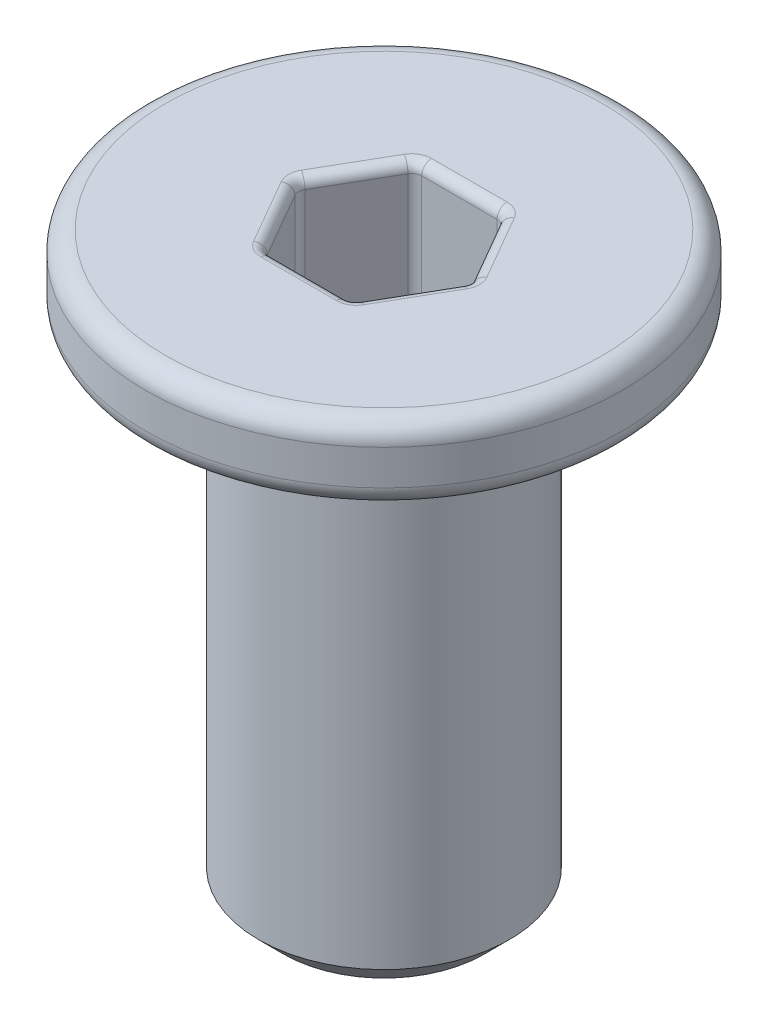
ISO-10303-21;
HEADER;
FILE_DESCRIPTION(('STEP AP214'),'2;1');
FILE_NAME('part.step','',(''),(''),'','','');
FILE_SCHEMA(('AUTOMOTIVE_DESIGN { 1 0 10303 214 1 1 1 1 }'));
ENDSEC;
DATA;
#1=APPLICATION_CONTEXT('core data for automotive mechanical design processes');
#2=APPLICATION_PROTOCOL_DEFINITION('international standard','automotive_design',2000,#1);
#3=PRODUCT_CONTEXT('',#1,'mechanical');
#4=PRODUCT('Part','Part','',(#3));
#5=PRODUCT_RELATED_PRODUCT_CATEGORY('part','',(#4));
#6=PRODUCT_DEFINITION_FORMATION('','',#4);
#7=PRODUCT_DEFINITION_CONTEXT('part definition',#1,'design');
#8=PRODUCT_DEFINITION('design','',#6,#7);
#9=PRODUCT_DEFINITION_SHAPE('','',#8);
#10=(LENGTH_UNIT() NAMED_UNIT(*) SI_UNIT(.MILLI.,.METRE.));
#11=(NAMED_UNIT(*) PLANE_ANGLE_UNIT() SI_UNIT($,.RADIAN.));
#12=(NAMED_UNIT(*) SI_UNIT($,.STERADIAN.) SOLID_ANGLE_UNIT());
#13=UNCERTAINTY_MEASURE_WITH_UNIT(LENGTH_MEASURE(1.E-05),#10,'distance_accuracy_value','');
#14=(GEOMETRIC_REPRESENTATION_CONTEXT(3) GLOBAL_UNCERTAINTY_ASSIGNED_CONTEXT((#13)) GLOBAL_UNIT_ASSIGNED_CONTEXT((#10,
#11,#12)) REPRESENTATION_CONTEXT('',''));
#15=CARTESIAN_POINT('',(0.,0.,0.));
#16=DIRECTION('',(0.,0.,1.));
#17=DIRECTION('',(1.,0.,0.));
#18=AXIS2_PLACEMENT_3D('',#15,#16,#17);
#19=CARTESIAN_POINT('',(0.,16.4999999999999,0.));
#20=DIRECTION('',(0.,1.,0.));
#21=DIRECTION('',(0.,0.,1.));
#22=AXIS2_PLACEMENT_3D('',#19,#20,#21);
#23=CYLINDRICAL_SURFACE('',#22,2.5);
#24=CARTESIAN_POINT('',(0.,-9.50000000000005,0.));
#25=DIRECTION('',(0.,1.,0.));
#26=DIRECTION('',(0.,0.,1.));
#27=AXIS2_PLACEMENT_3D('',#24,#25,#26);
#28=CIRCLE('',#27,2.5);
#29=CARTESIAN_POINT('',(0.,-9.50000000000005,2.5));
#30=VERTEX_POINT('',#29);
#31=EDGE_CURVE('E192',#30,#30,#28,.T.);
#32=ORIENTED_EDGE('',*,*,#31,.T.);
#33=EDGE_LOOP('',(#32));
#34=FACE_BOUND('',#33,.T.);
#35=CARTESIAN_POINT('',(0.,0.,0.));
#36=DIRECTION('',(0.,1.,0.));
#37=DIRECTION('',(0.,0.,1.));
#38=AXIS2_PLACEMENT_3D('',#35,#36,#37);
#39=CIRCLE('',#38,2.5);
#40=CARTESIAN_POINT('',(0.,0.,2.5));
#41=VERTEX_POINT('',#40);
#42=EDGE_CURVE('E285',#41,#41,#39,.T.);
#43=ORIENTED_EDGE('',*,*,#42,.F.);
#44=EDGE_LOOP('',(#43));
#45=FACE_BOUND('',#44,.T.);
#46=ADVANCED_FACE('F31',(#34,#45),#23,.T.);
#47=CARTESIAN_POINT('',(0.,-9.50000000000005,0.));
#48=DIRECTION('',(0.,1.,0.));
#49=DIRECTION('',(0.,0.,1.));
#50=AXIS2_PLACEMENT_3D('',#47,#48,#49);
#51=CONICAL_SURFACE('',#50,2.5,0.785398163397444);
#52=CARTESIAN_POINT('',(0.,-10.,0.));
#53=DIRECTION('',(0.,1.,0.));
#54=DIRECTION('',(0.,0.,1.));
#55=AXIS2_PLACEMENT_3D('',#52,#53,#54);
#56=CIRCLE('',#55,2.);
#57=CARTESIAN_POINT('',(0.,-10.,2.));
#58=VERTEX_POINT('',#57);
#59=EDGE_CURVE('E300',#58,#58,#56,.T.);
#60=ORIENTED_EDGE('',*,*,#59,.T.);
#61=EDGE_LOOP('',(#60));
#62=FACE_BOUND('',#61,.T.);
#63=ORIENTED_EDGE('',*,*,#31,.F.);
#64=EDGE_LOOP('',(#63));
#65=FACE_BOUND('',#64,.T.);
#66=ADVANCED_FACE('F524',(#62,#65),#51,.T.);
#67=CARTESIAN_POINT('',(-2.,-10.,0.));
#68=DIRECTION('',(0.,-1.,0.));
#69=DIRECTION('',(0.,0.,-1.));
#70=AXIS2_PLACEMENT_3D('',#67,#68,#69);
#71=PLANE('',#70);
#72=ORIENTED_EDGE('',*,*,#59,.F.);
#73=EDGE_LOOP('',(#72));
#74=FACE_BOUND('',#73,.T.);
#75=ADVANCED_FACE('F529',(#74),#71,.T.);
#76=CARTESIAN_POINT('',(-4.34999999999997,1.49999999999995,0.));
#77=DIRECTION('',(0.,1.,0.));
#78=DIRECTION('',(0.,0.,1.));
#79=AXIS2_PLACEMENT_3D('',#76,#77,#78);
#80=PLANE('',#79);
#81=CARTESIAN_POINT('',(0.750555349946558,1.49999999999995,1.30000000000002));
#82=DIRECTION('',(0.,1.,0.));
#83=DIRECTION('',(0.,0.,1.));
#84=AXIS2_PLACEMENT_3D('',#81,#82,#83);
#85=CIRCLE('',#84,0.4);
#86=CARTESIAN_POINT('',(0.750555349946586,1.49999999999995,1.70000000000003));
#87=VERTEX_POINT('',#86);
#88=CARTESIAN_POINT('',(1.09696551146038,1.49999999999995,1.50000000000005));
#89=VERTEX_POINT('',#88);
#90=EDGE_CURVE('E330',#87,#89,#85,.T.);
#91=ORIENTED_EDGE('',*,*,#90,.F.);
#92=DIRECTION('',(1.,0.,0.));
#93=VECTOR('',#92,1.);
#94=CARTESIAN_POINT('',(-0.866025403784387,1.49999999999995,1.70000000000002));
#95=LINE('',#94,#93);
#96=CARTESIAN_POINT('',(-0.750555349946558,1.49999999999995,1.70000000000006));
#97=VERTEX_POINT('',#96);
#98=EDGE_CURVE('E336',#87,#97,#95,.F.);
#99=ORIENTED_EDGE('',*,*,#98,.T.);
#100=CARTESIAN_POINT('',(-0.750555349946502,1.49999999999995,1.30000000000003));
#101=DIRECTION('',(0.,1.,0.));
#102=DIRECTION('',(0.,0.,1.));
#103=AXIS2_PLACEMENT_3D('',#100,#101,#102);
#104=CIRCLE('',#103,0.4);
#105=CARTESIAN_POINT('',(-1.0969655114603,1.49999999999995,1.50000000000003));
#106=VERTEX_POINT('',#105);
#107=EDGE_CURVE('E333',#106,#97,#104,.T.);
#108=ORIENTED_EDGE('',*,*,#107,.F.);
#109=DIRECTION('',(0.5,0.,0.866025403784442));
#110=VECTOR('',#109,1.);
#111=CARTESIAN_POINT('',(-1.03923048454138,1.49999999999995,1.60000000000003));
#112=LINE('',#111,#110);
#113=CARTESIAN_POINT('',(-1.8475208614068,1.49999999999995,0.199999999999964));
#114=VERTEX_POINT('',#113);
#115=EDGE_CURVE('E327',#106,#114,#112,.F.);
#116=ORIENTED_EDGE('',*,*,#115,.T.);
#117=CARTESIAN_POINT('',(-1.50111069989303,1.49999999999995,0.));
#118=DIRECTION('',(0.,1.,0.));
#119=DIRECTION('',(0.,0.,1.));
#120=AXIS2_PLACEMENT_3D('',#117,#118,#119);
#121=CIRCLE('',#120,0.4);
#122=CARTESIAN_POINT('',(-1.84752086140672,1.49999999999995,-0.199999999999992));
#123=VERTEX_POINT('',#122);
#124=EDGE_CURVE('E324',#123,#114,#121,.T.);
#125=ORIENTED_EDGE('',*,*,#124,.F.);
#126=DIRECTION('',(-0.499999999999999,0.,0.866025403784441));
#127=VECTOR('',#126,1.);
#128=CARTESIAN_POINT('',(-1.03923048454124,1.49999999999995,-1.59999999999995));
#129=LINE('',#128,#127);
#130=CARTESIAN_POINT('',(-1.09696551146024,1.49999999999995,-1.49999999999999));
#131=VERTEX_POINT('',#130);
#132=EDGE_CURVE('E322',#123,#131,#129,.F.);
#133=ORIENTED_EDGE('',*,*,#132,.T.);
#134=CARTESIAN_POINT('',(-0.750555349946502,1.49999999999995,-1.29999999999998));
#135=DIRECTION('',(0.,1.,0.));
#136=DIRECTION('',(0.,0.,1.));
#137=AXIS2_PLACEMENT_3D('',#134,#135,#136);
#138=CIRCLE('',#137,0.4);
#139=CARTESIAN_POINT('',(-0.750555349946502,1.49999999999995,-1.69999999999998));
#140=VERTEX_POINT('',#139);
#141=EDGE_CURVE('E319',#140,#131,#138,.T.);
#142=ORIENTED_EDGE('',*,*,#141,.F.);
#143=DIRECTION('',(-1.,0.,0.));
#144=VECTOR('',#143,1.);
#145=CARTESIAN_POINT('',(-0.866025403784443,1.49999999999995,-1.69999999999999));
#146=LINE('',#145,#144);
#147=CARTESIAN_POINT('',(0.750555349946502,1.49999999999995,-1.70000000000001));
#148=VERTEX_POINT('',#147);
#149=EDGE_CURVE('E317',#140,#148,#146,.F.);
#150=ORIENTED_EDGE('',*,*,#149,.T.);
#151=CARTESIAN_POINT('',(0.75055534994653,1.49999999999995,-1.29999999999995));
#152=DIRECTION('',(0.,1.,0.));
#153=DIRECTION('',(0.,0.,1.));
#154=AXIS2_PLACEMENT_3D('',#151,#152,#153);
#155=CIRCLE('',#154,0.4);
#156=CARTESIAN_POINT('',(1.0969655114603,1.49999999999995,-1.50000000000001));
#157=VERTEX_POINT('',#156);
#158=EDGE_CURVE('E314',#157,#148,#155,.T.);
#159=ORIENTED_EDGE('',*,*,#158,.F.);
#160=DIRECTION('',(-0.499999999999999,0.,-0.866025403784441));
#161=VECTOR('',#160,1.);
#162=CARTESIAN_POINT('',(1.03923048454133,1.49999999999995,-1.59999999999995));
#163=LINE('',#162,#161);
#164=CARTESIAN_POINT('',(1.84752086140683,1.49999999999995,-0.19999999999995));
#165=VERTEX_POINT('',#164);
#166=EDGE_CURVE('E310',#157,#165,#163,.F.);
#167=ORIENTED_EDGE('',*,*,#166,.T.);
#168=CARTESIAN_POINT('',(1.50111069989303,1.49999999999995,0.));
#169=DIRECTION('',(0.,1.,0.));
#170=DIRECTION('',(0.,0.,1.));
#171=AXIS2_PLACEMENT_3D('',#168,#169,#170);
#172=CIRCLE('',#171,0.4);
#173=CARTESIAN_POINT('',(1.84752086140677,1.49999999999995,0.20000000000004));
#174=VERTEX_POINT('',#173);
#175=EDGE_CURVE('E307',#174,#165,#172,.T.);
#176=ORIENTED_EDGE('',*,*,#175,.F.);
#177=DIRECTION('',(0.5,0.,-0.866025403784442));
#178=VECTOR('',#177,1.);
#179=CARTESIAN_POINT('',(1.03923048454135,1.49999999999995,1.60000000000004));
#180=LINE('',#179,#178);
#181=EDGE_CURVE('E312',#174,#89,#180,.F.);
#182=ORIENTED_EDGE('',*,*,#181,.T.);
#183=EDGE_LOOP('',(#91,#99,#108,#116,#125,#133,#142,#150,#159,#167,#176,#182));
#184=FACE_BOUND('',#183,.T.);
#185=CARTESIAN_POINT('',(0.,1.49999999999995,0.));
#186=DIRECTION('',(0.,1.,0.));
#187=DIRECTION('',(0.,0.,1.));
#188=AXIS2_PLACEMENT_3D('',#185,#186,#187);
#189=CIRCLE('',#188,4.35);
#190=CARTESIAN_POINT('',(0.,1.49999999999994,4.35000000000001));
#191=VERTEX_POINT('',#190);
#192=EDGE_CURVE('E297',#191,#191,#189,.T.);
#193=ORIENTED_EDGE('',*,*,#192,.T.);
#194=EDGE_LOOP('',(#193));
#195=FACE_BOUND('',#194,.T.);
#196=ADVANCED_FACE('F450',(#184,#195),#80,.T.);
#197=CARTESIAN_POINT('',(0.,1.09999999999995,0.));
#198=DIRECTION('',(0.,1.,0.));
#199=DIRECTION('',(0.,0.,1.));
#200=AXIS2_PLACEMENT_3D('',#197,#198,#199);
#201=TOROIDAL_SURFACE('',#200,4.35,0.4);
#202=CARTESIAN_POINT('',(0.,1.09999999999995,0.));
#203=DIRECTION('',(0.,1.,0.));
#204=DIRECTION('',(0.,0.,1.));
#205=AXIS2_PLACEMENT_3D('',#202,#203,#204);
#206=CIRCLE('',#205,4.75);
#207=CARTESIAN_POINT('',(0.,1.09999999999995,4.75000000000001));
#208=VERTEX_POINT('',#207);
#209=EDGE_CURVE('E294',#208,#208,#206,.T.);
#210=ORIENTED_EDGE('',*,*,#209,.T.);
#211=EDGE_LOOP('',(#210));
#212=FACE_BOUND('',#211,.T.);
#213=ORIENTED_EDGE('',*,*,#192,.F.);
#214=EDGE_LOOP('',(#213));
#215=FACE_BOUND('',#214,.T.);
#216=ADVANCED_FACE('F550',(#212,#215),#201,.T.);
#217=CARTESIAN_POINT('',(0.,16.4999999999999,0.));
#218=DIRECTION('',(0.,1.,0.));
#219=DIRECTION('',(0.,0.,1.));
#220=AXIS2_PLACEMENT_3D('',#217,#218,#219);
#221=CYLINDRICAL_SURFACE('',#220,4.75);
#222=CARTESIAN_POINT('',(0.,0.399999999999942,0.));
#223=DIRECTION('',(0.,1.,0.));
#224=DIRECTION('',(0.,0.,1.));
#225=AXIS2_PLACEMENT_3D('',#222,#223,#224);
#226=CIRCLE('',#225,4.75);
#227=CARTESIAN_POINT('',(0.,0.399999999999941,4.75000000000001));
#228=VERTEX_POINT('',#227);
#229=EDGE_CURVE('E291',#228,#228,#226,.T.);
#230=ORIENTED_EDGE('',*,*,#229,.T.);
#231=EDGE_LOOP('',(#230));
#232=FACE_BOUND('',#231,.T.);
#233=ORIENTED_EDGE('',*,*,#209,.F.);
#234=EDGE_LOOP('',(#233));
#235=FACE_BOUND('',#234,.T.);
#236=ADVANCED_FACE('F544',(#232,#235),#221,.T.);
#237=CARTESIAN_POINT('',(0.,0.399999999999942,0.));
#238=DIRECTION('',(0.,1.,0.));
#239=DIRECTION('',(0.,0.,1.));
#240=AXIS2_PLACEMENT_3D('',#237,#238,#239);
#241=TOROIDAL_SURFACE('',#240,4.35,0.4);
#242=CARTESIAN_POINT('',(0.,0.,0.));
#243=DIRECTION('',(0.,1.,0.));
#244=DIRECTION('',(0.,0.,1.));
#245=AXIS2_PLACEMENT_3D('',#242,#243,#244);
#246=CIRCLE('',#245,4.35);
#247=CARTESIAN_POINT('',(0.,0.,4.35000000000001));
#248=VERTEX_POINT('',#247);
#249=EDGE_CURVE('E288',#248,#248,#246,.T.);
#250=ORIENTED_EDGE('',*,*,#249,.T.);
#251=EDGE_LOOP('',(#250));
#252=FACE_BOUND('',#251,.T.);
#253=ORIENTED_EDGE('',*,*,#229,.F.);
#254=EDGE_LOOP('',(#253));
#255=FACE_BOUND('',#254,.T.);
#256=ADVANCED_FACE('F538',(#252,#255),#241,.T.);
#257=CARTESIAN_POINT('',(-2.49999999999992,0.,0.));
#258=DIRECTION('',(0.,-1.,0.));
#259=DIRECTION('',(0.,0.,-1.));
#260=AXIS2_PLACEMENT_3D('',#257,#258,#259);
#261=PLANE('',#260);
#262=ORIENTED_EDGE('',*,*,#42,.T.);
#263=EDGE_LOOP('',(#262));
#264=FACE_BOUND('',#263,.T.);
#265=ORIENTED_EDGE('',*,*,#249,.F.);
#266=EDGE_LOOP('',(#265));
#267=FACE_BOUND('',#266,.T.);
#268=ADVANCED_FACE('F535',(#264,#267),#261,.T.);
#269=CARTESIAN_POINT('',(-0.86602540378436,-3.50000000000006,1.50000000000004));
#270=DIRECTION('',(0.,0.,1.));
#271=DIRECTION('',(1.,0.,0.));
#272=AXIS2_PLACEMENT_3D('',#269,#270,#271);
#273=PLANE('',#272);
#274=DIRECTION('',(1.,0.,0.));
#275=VECTOR('',#274,1.);
#276=CARTESIAN_POINT('',(-0.86602540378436,-3.30000000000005,1.50000000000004));
#277=LINE('',#276,#275);
#278=CARTESIAN_POINT('',(0.750555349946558,-3.30000000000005,1.50000000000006));
#279=VERTEX_POINT('',#278);
#280=CARTESIAN_POINT('',(-0.750555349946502,-3.30000000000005,1.50000000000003));
#281=VERTEX_POINT('',#280);
#282=EDGE_CURVE('E356',#279,#281,#277,.F.);
#283=ORIENTED_EDGE('',*,*,#282,.T.);
#284=DIRECTION('',(0.,1.,0.));
#285=VECTOR('',#284,1.);
#286=CARTESIAN_POINT('',(-0.750555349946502,-3.50000000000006,1.50000000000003));
#287=LINE('',#286,#285);
#288=CARTESIAN_POINT('',(-0.750555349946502,1.29999999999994,1.50000000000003));
#289=VERTEX_POINT('',#288);
#290=EDGE_CURVE('E204',#281,#289,#287,.T.);
#291=ORIENTED_EDGE('',*,*,#290,.T.);
#292=DIRECTION('',(1.,0.,0.));
#293=VECTOR('',#292,1.);
#294=CARTESIAN_POINT('',(-0.86602540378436,1.29999999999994,1.50000000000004));
#295=LINE('',#294,#293);
#296=CARTESIAN_POINT('',(0.750555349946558,1.29999999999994,1.50000000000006));
#297=VERTEX_POINT('',#296);
#298=EDGE_CURVE('E360',#289,#297,#295,.T.);
#299=ORIENTED_EDGE('',*,*,#298,.T.);
#300=DIRECTION('',(0.,1.,0.));
#301=VECTOR('',#300,1.);
#302=CARTESIAN_POINT('',(0.750555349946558,-3.50000000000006,1.50000000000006));
#303=LINE('',#302,#301);
#304=EDGE_CURVE('E358',#297,#279,#303,.F.);
#305=ORIENTED_EDGE('',*,*,#304,.T.);
#306=EDGE_LOOP('',(#283,#291,#299,#305));
#307=FACE_BOUND('',#306,.T.);
#308=ADVANCED_FACE('F488',(#307),#273,.F.);
#309=CARTESIAN_POINT('',(-0.86602540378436,-3.50000000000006,1.50000000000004));
#310=DIRECTION('',(-0.866025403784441,0.,0.499999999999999));
#311=DIRECTION('',(0.5,0.,0.866025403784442));
#312=AXIS2_PLACEMENT_3D('',#309,#310,#311);
#313=PLANE('',#312);
#314=DIRECTION('',(0.,1.,0.));
#315=VECTOR('',#314,1.);
#316=CARTESIAN_POINT('',(-1.67431578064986,-3.50000000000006,0.100000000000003));
#317=LINE('',#316,#315);
#318=CARTESIAN_POINT('',(-1.67431578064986,-3.30000000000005,0.100000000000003));
#319=VERTEX_POINT('',#318);
#320=CARTESIAN_POINT('',(-1.67431578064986,1.29999999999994,0.100000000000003));
#321=VERTEX_POINT('',#320);
#322=EDGE_CURVE('E181',#319,#321,#317,.T.);
#323=ORIENTED_EDGE('',*,*,#322,.T.);
#324=DIRECTION('',(0.5,0.,0.866025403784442));
#325=VECTOR('',#324,1.);
#326=CARTESIAN_POINT('',(-0.86602540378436,1.29999999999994,1.50000000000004));
#327=LINE('',#326,#325);
#328=CARTESIAN_POINT('',(-0.923760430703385,1.29999999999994,1.4));
#329=VERTEX_POINT('',#328);
#330=EDGE_CURVE('E177',#321,#329,#327,.T.);
#331=ORIENTED_EDGE('',*,*,#330,.T.);
#332=DIRECTION('',(0.,1.,0.));
#333=VECTOR('',#332,1.);
#334=CARTESIAN_POINT('',(-0.923760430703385,-3.50000000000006,1.4));
#335=LINE('',#334,#333);
#336=CARTESIAN_POINT('',(-0.923760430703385,-3.30000000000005,1.4));
#337=VERTEX_POINT('',#336);
#338=EDGE_CURVE('E171',#329,#337,#335,.F.);
#339=ORIENTED_EDGE('',*,*,#338,.T.);
#340=DIRECTION('',(0.5,0.,0.866025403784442));
#341=VECTOR('',#340,1.);
#342=CARTESIAN_POINT('',(-0.86602540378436,-3.30000000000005,1.50000000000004));
#343=LINE('',#342,#341);
#344=EDGE_CURVE('E174',#337,#319,#343,.F.);
#345=ORIENTED_EDGE('',*,*,#344,.T.);
#346=EDGE_LOOP('',(#323,#331,#339,#345));
#347=FACE_BOUND('',#346,.T.);
#348=ADVANCED_FACE('F173',(#347),#313,.F.);
#349=CARTESIAN_POINT('',(-0.866025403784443,-3.50000000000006,-1.49999999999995));
#350=DIRECTION('',(-0.866025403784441,0.,-0.499999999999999));
#351=DIRECTION('',(-0.499999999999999,0.,0.866025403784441));
#352=AXIS2_PLACEMENT_3D('',#349,#350,#351);
#353=PLANE('',#352);
#354=DIRECTION('',(-0.499999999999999,0.,0.866025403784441));
#355=VECTOR('',#354,1.);
#356=CARTESIAN_POINT('',(-0.866025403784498,1.29999999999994,-1.49999999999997));
#357=LINE('',#356,#355);
#358=CARTESIAN_POINT('',(-0.923760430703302,1.29999999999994,-1.39999999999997));
#359=VERTEX_POINT('',#358);
#360=CARTESIAN_POINT('',(-1.67431578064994,1.29999999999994,-0.0999999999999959));
#361=VERTEX_POINT('',#360);
#362=EDGE_CURVE('E342',#359,#361,#357,.T.);
#363=ORIENTED_EDGE('',*,*,#362,.T.);
#364=DIRECTION('',(0.,1.,0.));
#365=VECTOR('',#364,1.);
#366=CARTESIAN_POINT('',(-1.67431578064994,-3.50000000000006,-0.0999999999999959));
#367=LINE('',#366,#365);
#368=CARTESIAN_POINT('',(-1.67431578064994,-3.30000000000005,-0.0999999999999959));
#369=VERTEX_POINT('',#368);
#370=EDGE_CURVE('E344',#361,#369,#367,.F.);
#371=ORIENTED_EDGE('',*,*,#370,.T.);
#372=DIRECTION('',(-0.499999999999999,0.,0.866025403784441));
#373=VECTOR('',#372,1.);
#374=CARTESIAN_POINT('',(-0.866025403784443,-3.30000000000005,-1.49999999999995));
#375=LINE('',#374,#373);
#376=CARTESIAN_POINT('',(-0.923760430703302,-3.30000000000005,-1.39999999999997));
#377=VERTEX_POINT('',#376);
#378=EDGE_CURVE('E338',#369,#377,#375,.F.);
#379=ORIENTED_EDGE('',*,*,#378,.T.);
#380=DIRECTION('',(0.,1.,0.));
#381=VECTOR('',#380,1.);
#382=CARTESIAN_POINT('',(-0.923760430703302,-3.50000000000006,-1.39999999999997));
#383=LINE('',#382,#381);
#384=EDGE_CURVE('E340',#377,#359,#383,.T.);
#385=ORIENTED_EDGE('',*,*,#384,.T.);
#386=EDGE_LOOP('',(#363,#371,#379,#385));
#387=FACE_BOUND('',#386,.T.);
#388=ADVANCED_FACE('F577',(#387),#353,.F.);
#389=CARTESIAN_POINT('',(-0.866025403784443,-3.50000000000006,-1.49999999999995));
#390=DIRECTION('',(0.,0.,-1.));
#391=DIRECTION('',(-1.,0.,0.));
#392=AXIS2_PLACEMENT_3D('',#389,#390,#391);
#393=PLANE('',#392);
#394=DIRECTION('',(-1.,0.,0.));
#395=VECTOR('',#394,1.);
#396=CARTESIAN_POINT('',(-0.866025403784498,1.29999999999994,-1.49999999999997));
#397=LINE('',#396,#395);
#398=CARTESIAN_POINT('',(0.750555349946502,1.29999999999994,-1.50000000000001));
#399=VERTEX_POINT('',#398);
#400=CARTESIAN_POINT('',(-0.750555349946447,1.29999999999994,-1.49999999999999));
#401=VERTEX_POINT('',#400);
#402=EDGE_CURVE('E351',#399,#401,#397,.T.);
#403=ORIENTED_EDGE('',*,*,#402,.T.);
#404=DIRECTION('',(0.,1.,0.));
#405=VECTOR('',#404,1.);
#406=CARTESIAN_POINT('',(-0.750555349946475,-3.50000000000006,-1.49999999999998));
#407=LINE('',#406,#405);
#408=CARTESIAN_POINT('',(-0.750555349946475,-3.30000000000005,-1.49999999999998));
#409=VERTEX_POINT('',#408);
#410=EDGE_CURVE('E353',#401,#409,#407,.F.);
#411=ORIENTED_EDGE('',*,*,#410,.T.);
#412=DIRECTION('',(-1.,0.,0.));
#413=VECTOR('',#412,1.);
#414=CARTESIAN_POINT('',(-0.866025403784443,-3.30000000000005,-1.49999999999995));
#415=LINE('',#414,#413);
#416=CARTESIAN_POINT('',(0.750555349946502,-3.30000000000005,-1.50000000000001));
#417=VERTEX_POINT('',#416);
#418=EDGE_CURVE('E347',#409,#417,#415,.F.);
#419=ORIENTED_EDGE('',*,*,#418,.T.);
#420=DIRECTION('',(0.,1.,0.));
#421=VECTOR('',#420,1.);
#422=CARTESIAN_POINT('',(0.750555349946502,-3.50000000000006,-1.50000000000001));
#423=LINE('',#422,#421);
#424=EDGE_CURVE('E349',#417,#399,#423,.T.);
#425=ORIENTED_EDGE('',*,*,#424,.T.);
#426=EDGE_LOOP('',(#403,#411,#419,#425));
#427=FACE_BOUND('',#426,.T.);
#428=ADVANCED_FACE('F573',(#427),#393,.F.);
#429=CARTESIAN_POINT('',(0.866025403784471,-3.50000000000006,-1.49999999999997));
#430=DIRECTION('',(0.866025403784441,0.,-0.499999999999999));
#431=DIRECTION('',(-0.499999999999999,0.,-0.866025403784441));
#432=AXIS2_PLACEMENT_3D('',#429,#430,#431);
#433=PLANE('',#432);
#434=DIRECTION('',(0.,1.,0.));
#435=VECTOR('',#434,1.);
#436=CARTESIAN_POINT('',(1.67431578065,-3.50000000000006,-0.0999999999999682));
#437=LINE('',#436,#435);
#438=CARTESIAN_POINT('',(1.67431578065,-3.30000000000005,-0.0999999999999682));
#439=VERTEX_POINT('',#438);
#440=CARTESIAN_POINT('',(1.67431578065,1.29999999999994,-0.0999999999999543));
#441=VERTEX_POINT('',#440);
#442=EDGE_CURVE('E376',#439,#441,#437,.T.);
#443=ORIENTED_EDGE('',*,*,#442,.T.);
#444=DIRECTION('',(-0.499999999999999,0.,-0.866025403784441));
#445=VECTOR('',#444,1.);
#446=CARTESIAN_POINT('',(0.866025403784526,1.29999999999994,-1.49999999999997));
#447=LINE('',#446,#445);
#448=CARTESIAN_POINT('',(0.923760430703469,1.29999999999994,-1.39999999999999));
#449=VERTEX_POINT('',#448);
#450=EDGE_CURVE('E379',#441,#449,#447,.T.);
#451=ORIENTED_EDGE('',*,*,#450,.T.);
#452=DIRECTION('',(0.,1.,0.));
#453=VECTOR('',#452,1.);
#454=CARTESIAN_POINT('',(0.923760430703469,-3.50000000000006,-1.39999999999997));
#455=LINE('',#454,#453);
#456=CARTESIAN_POINT('',(0.923760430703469,-3.30000000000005,-1.39999999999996));
#457=VERTEX_POINT('',#456);
#458=EDGE_CURVE('E374',#449,#457,#455,.F.);
#459=ORIENTED_EDGE('',*,*,#458,.T.);
#460=DIRECTION('',(-0.499999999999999,0.,-0.866025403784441));
#461=VECTOR('',#460,1.);
#462=CARTESIAN_POINT('',(0.866025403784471,-3.30000000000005,-1.49999999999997));
#463=LINE('',#462,#461);
#464=EDGE_CURVE('E372',#457,#439,#463,.F.);
#465=ORIENTED_EDGE('',*,*,#464,.T.);
#466=EDGE_LOOP('',(#443,#451,#459,#465));
#467=FACE_BOUND('',#466,.T.);
#468=ADVANCED_FACE('F570',(#467),#433,.F.);
#469=CARTESIAN_POINT('',(0.866025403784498,-3.50000000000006,1.50000000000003));
#470=DIRECTION('',(0.866025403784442,0.,0.499999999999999));
#471=DIRECTION('',(0.5,0.,-0.866025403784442));
#472=AXIS2_PLACEMENT_3D('',#469,#470,#471);
#473=PLANE('',#472);
#474=DIRECTION('',(0.5,0.,-0.866025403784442));
#475=VECTOR('',#474,1.);
#476=CARTESIAN_POINT('',(0.866025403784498,-3.30000000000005,1.50000000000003));
#477=LINE('',#476,#475);
#478=CARTESIAN_POINT('',(1.67431578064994,-3.30000000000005,0.100000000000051));
#479=VERTEX_POINT('',#478);
#480=CARTESIAN_POINT('',(0.923760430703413,-3.30000000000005,1.40000000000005));
#481=VERTEX_POINT('',#480);
#482=EDGE_CURVE('E363',#479,#481,#477,.F.);
#483=ORIENTED_EDGE('',*,*,#482,.T.);
#484=DIRECTION('',(0.,1.,0.));
#485=VECTOR('',#484,1.);
#486=CARTESIAN_POINT('',(0.923760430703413,-3.50000000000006,1.40000000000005));
#487=LINE('',#486,#485);
#488=CARTESIAN_POINT('',(0.923760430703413,1.29999999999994,1.40000000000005));
#489=VERTEX_POINT('',#488);
#490=EDGE_CURVE('E369',#481,#489,#487,.T.);
#491=ORIENTED_EDGE('',*,*,#490,.T.);
#492=DIRECTION('',(0.5,0.,-0.866025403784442));
#493=VECTOR('',#492,1.);
#494=CARTESIAN_POINT('',(0.866025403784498,1.29999999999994,1.50000000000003));
#495=LINE('',#494,#493);
#496=CARTESIAN_POINT('',(1.67431578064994,1.29999999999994,0.100000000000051));
#497=VERTEX_POINT('',#496);
#498=EDGE_CURVE('E367',#489,#497,#495,.T.);
#499=ORIENTED_EDGE('',*,*,#498,.T.);
#500=DIRECTION('',(0.,1.,0.));
#501=VECTOR('',#500,1.);
#502=CARTESIAN_POINT('',(1.67431578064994,-3.50000000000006,0.100000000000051));
#503=LINE('',#502,#501);
#504=EDGE_CURVE('E365',#497,#479,#503,.F.);
#505=ORIENTED_EDGE('',*,*,#504,.T.);
#506=EDGE_LOOP('',(#483,#491,#499,#505));
#507=FACE_BOUND('',#506,.T.);
#508=ADVANCED_FACE('F505',(#507),#473,.F.);
#509=CARTESIAN_POINT('',(0.866025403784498,-3.50000000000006,1.50000000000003));
#510=DIRECTION('',(0.,1.,0.));
#511=DIRECTION('',(0.,0.,1.));
#512=AXIS2_PLACEMENT_3D('',#509,#510,#511);
#513=PLANE('',#512);
#514=DIRECTION('',(-0.499999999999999,0.,0.866025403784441));
#515=VECTOR('',#514,1.);
#516=CARTESIAN_POINT('',(-1.55884572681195,-3.50000000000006,0.100000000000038));
#517=LINE('',#516,#515);
#518=CARTESIAN_POINT('',(-0.750555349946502,-3.50000000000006,-1.29999999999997));
#519=VERTEX_POINT('',#518);
#520=CARTESIAN_POINT('',(-1.50111069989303,-3.50000000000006,0.));
#521=VERTEX_POINT('',#520);
#522=EDGE_CURVE('E38',#519,#521,#517,.T.);
#523=ORIENTED_EDGE('',*,*,#522,.T.);
#524=DIRECTION('',(0.5,0.,0.866025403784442));
#525=VECTOR('',#524,1.);
#526=CARTESIAN_POINT('',(-0.259807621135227,-3.50000000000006,2.15000000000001));
#527=LINE('',#526,#525);
#528=CARTESIAN_POINT('',(-0.75055534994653,-3.50000000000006,1.30000000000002));
#529=VERTEX_POINT('',#528);
#530=EDGE_CURVE('E11',#521,#529,#527,.T.);
#531=ORIENTED_EDGE('',*,*,#530,.T.);
#532=DIRECTION('',(1.,0.,0.));
#533=VECTOR('',#532,1.);
#534=CARTESIAN_POINT('',(0.866025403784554,-3.50000000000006,1.30000000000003));
#535=LINE('',#534,#533);
#536=CARTESIAN_POINT('',(0.750555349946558,-3.50000000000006,1.30000000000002));
#537=VERTEX_POINT('',#536);
#538=EDGE_CURVE('E381',#529,#537,#535,.T.);
#539=ORIENTED_EDGE('',*,*,#538,.T.);
#540=DIRECTION('',(0.5,0.,-0.866025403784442));
#541=VECTOR('',#540,1.);
#542=CARTESIAN_POINT('',(0.692820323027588,-3.50000000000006,1.40000000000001));
#543=LINE('',#542,#541);
#544=CARTESIAN_POINT('',(1.50111069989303,-3.50000000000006,0.));
#545=VERTEX_POINT('',#544);
#546=EDGE_CURVE('E383',#537,#545,#543,.T.);
#547=ORIENTED_EDGE('',*,*,#546,.T.);
#548=DIRECTION('',(-0.499999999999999,0.,-0.866025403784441));
#549=VECTOR('',#548,1.);
#550=CARTESIAN_POINT('',(1.99185842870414,-3.50000000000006,0.850000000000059));
#551=LINE('',#550,#549);
#552=CARTESIAN_POINT('',(0.75055534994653,-3.50000000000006,-1.29999999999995));
#553=VERTEX_POINT('',#552);
#554=EDGE_CURVE('E385',#545,#553,#551,.T.);
#555=ORIENTED_EDGE('',*,*,#554,.T.);
#556=DIRECTION('',(-1.,0.,0.));
#557=VECTOR('',#556,1.);
#558=CARTESIAN_POINT('',(0.866025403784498,-3.50000000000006,-1.29999999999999));
#559=LINE('',#558,#557);
#560=EDGE_CURVE('E48',#553,#519,#559,.T.);
#561=ORIENTED_EDGE('',*,*,#560,.T.);
#562=EDGE_LOOP('',(#523,#531,#539,#547,#555,#561));
#563=FACE_BOUND('',#562,.T.);
#564=ADVANCED_FACE('F389',(#563),#513,.T.);
#565=CARTESIAN_POINT('',(1.99185842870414,-3.30000000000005,0.850000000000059));
#566=DIRECTION('',(-0.499999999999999,0.,-0.866025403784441));
#567=DIRECTION('',(-0.866025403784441,0.,0.499999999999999));
#568=AXIS2_PLACEMENT_3D('',#565,#566,#567);
#569=CYLINDRICAL_SURFACE('',#568,0.2);
#570=CARTESIAN_POINT('',(0.75055534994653,-3.30000000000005,-1.29999999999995));
#571=DIRECTION('',(0.499999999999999,0.,0.866025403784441));
#572=DIRECTION('',(0.866025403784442,0.,-0.499999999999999));
#573=AXIS2_PLACEMENT_3D('',#570,#571,#572);
#574=CIRCLE('',#573,0.2);
#575=EDGE_CURVE('E282',#553,#457,#574,.T.);
#576=ORIENTED_EDGE('',*,*,#575,.F.);
#577=ORIENTED_EDGE('',*,*,#554,.F.);
#578=CARTESIAN_POINT('',(1.50111069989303,-3.30000000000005,0.));
#579=DIRECTION('',(-0.499999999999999,0.,-0.866025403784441));
#580=DIRECTION('',(-0.866025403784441,0.,0.499999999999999));
#581=AXIS2_PLACEMENT_3D('',#578,#579,#580);
#582=CIRCLE('',#581,0.2);
#583=EDGE_CURVE('E279',#439,#545,#582,.T.);
#584=ORIENTED_EDGE('',*,*,#583,.F.);
#585=ORIENTED_EDGE('',*,*,#464,.F.);
#586=EDGE_LOOP('',(#576,#577,#584,#585));
#587=FACE_BOUND('',#586,.T.);
#588=ADVANCED_FACE('F395',(#587),#569,.F.);
#589=CARTESIAN_POINT('',(0.75055534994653,-3.30000000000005,-1.29999999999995));
#590=DIRECTION('',(0.,0.,1.));
#591=DIRECTION('',(1.,0.,0.));
#592=AXIS2_PLACEMENT_3D('',#589,#590,#591);
#593=SPHERICAL_SURFACE('',#592,0.2);
#594=CARTESIAN_POINT('',(0.75055534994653,-3.30000000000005,-1.29999999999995));
#595=DIRECTION('',(-1.,0.,0.));
#596=DIRECTION('',(0.,-1.,0.));
#597=AXIS2_PLACEMENT_3D('',#594,#595,#596);
#598=CIRCLE('',#597,0.2);
#599=EDGE_CURVE('E273',#553,#417,#598,.F.);
#600=ORIENTED_EDGE('',*,*,#599,.F.);
#601=ORIENTED_EDGE('',*,*,#575,.T.);
#602=CARTESIAN_POINT('',(0.75055534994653,-3.30000000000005,-1.29999999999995));
#603=DIRECTION('',(0.,1.,0.));
#604=DIRECTION('',(0.,0.,1.));
#605=AXIS2_PLACEMENT_3D('',#602,#603,#604);
#606=CIRCLE('',#605,0.2);
#607=EDGE_CURVE('E276',#417,#457,#606,.F.);
#608=ORIENTED_EDGE('',*,*,#607,.F.);
#609=EDGE_LOOP('',(#600,#601,#608));
#610=FACE_BOUND('',#609,.T.);
#611=ADVANCED_FACE('F398',(#610),#593,.F.);
#612=CARTESIAN_POINT('',(1.50111069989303,-3.30000000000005,0.));
#613=DIRECTION('',(0.,0.,1.));
#614=DIRECTION('',(1.,0.,0.));
#615=AXIS2_PLACEMENT_3D('',#612,#613,#614);
#616=SPHERICAL_SURFACE('',#615,0.2);
#617=CARTESIAN_POINT('',(1.50111069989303,-3.30000000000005,0.));
#618=DIRECTION('',(0.,1.,0.));
#619=DIRECTION('',(0.,0.,1.));
#620=AXIS2_PLACEMENT_3D('',#617,#618,#619);
#621=CIRCLE('',#620,0.2);
#622=EDGE_CURVE('E267',#439,#479,#621,.F.);
#623=ORIENTED_EDGE('',*,*,#622,.F.);
#624=ORIENTED_EDGE('',*,*,#583,.T.);
#625=CARTESIAN_POINT('',(1.50111069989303,-3.30000000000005,0.));
#626=DIRECTION('',(-0.499999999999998,0.,0.866025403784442));
#627=DIRECTION('',(0.866025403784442,0.,0.499999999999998));
#628=AXIS2_PLACEMENT_3D('',#625,#626,#627);
#629=CIRCLE('',#628,0.2);
#630=EDGE_CURVE('E270',#479,#545,#629,.F.);
#631=ORIENTED_EDGE('',*,*,#630,.F.);
#632=EDGE_LOOP('',(#623,#624,#631));
#633=FACE_BOUND('',#632,.T.);
#634=ADVANCED_FACE('F512',(#633),#616,.F.);
#635=CARTESIAN_POINT('',(0.75055534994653,-3.50000000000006,-1.29999999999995));
#636=DIRECTION('',(0.,-1.,0.));
#637=DIRECTION('',(0.,0.,-1.));
#638=AXIS2_PLACEMENT_3D('',#635,#636,#637);
#639=CYLINDRICAL_SURFACE('',#638,0.2);
#640=ORIENTED_EDGE('',*,*,#607,.T.);
#641=ORIENTED_EDGE('',*,*,#458,.F.);
#642=CARTESIAN_POINT('',(0.75055534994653,1.29999999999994,-1.29999999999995));
#643=DIRECTION('',(0.,1.,0.));
#644=DIRECTION('',(0.,0.,1.));
#645=AXIS2_PLACEMENT_3D('',#642,#643,#644);
#646=CIRCLE('',#645,0.2);
#647=EDGE_CURVE('E261',#399,#449,#646,.F.);
#648=ORIENTED_EDGE('',*,*,#647,.F.);
#649=ORIENTED_EDGE('',*,*,#424,.F.);
#650=EDGE_LOOP('',(#640,#641,#648,#649));
#651=FACE_BOUND('',#650,.T.);
#652=ADVANCED_FACE('F514',(#651),#639,.F.);
#653=CARTESIAN_POINT('',(0.866025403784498,-3.30000000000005,-1.29999999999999));
#654=DIRECTION('',(-1.,0.,0.));
#655=DIRECTION('',(0.,0.,1.));
#656=AXIS2_PLACEMENT_3D('',#653,#654,#655);
#657=CYLINDRICAL_SURFACE('',#656,0.2);
#658=ORIENTED_EDGE('',*,*,#599,.T.);
#659=ORIENTED_EDGE('',*,*,#418,.F.);
#660=CARTESIAN_POINT('',(-0.750555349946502,-3.30000000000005,-1.29999999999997));
#661=DIRECTION('',(1.,0.,0.));
#662=DIRECTION('',(0.,0.,-1.));
#663=AXIS2_PLACEMENT_3D('',#660,#661,#662);
#664=CIRCLE('',#663,0.2);
#665=EDGE_CURVE('E258',#519,#409,#664,.T.);
#666=ORIENTED_EDGE('',*,*,#665,.F.);
#667=ORIENTED_EDGE('',*,*,#560,.F.);
#668=EDGE_LOOP('',(#658,#659,#666,#667));
#669=FACE_BOUND('',#668,.T.);
#670=ADVANCED_FACE('F402',(#669),#657,.F.);
#671=CARTESIAN_POINT('',(0.692820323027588,-3.30000000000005,1.40000000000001));
#672=DIRECTION('',(0.5,0.,-0.866025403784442));
#673=DIRECTION('',(-0.866025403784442,0.,-0.499999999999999));
#674=AXIS2_PLACEMENT_3D('',#671,#672,#673);
#675=CYLINDRICAL_SURFACE('',#674,0.2);
#676=ORIENTED_EDGE('',*,*,#630,.T.);
#677=ORIENTED_EDGE('',*,*,#546,.F.);
#678=CARTESIAN_POINT('',(0.750555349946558,-3.30000000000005,1.30000000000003));
#679=DIRECTION('',(0.499999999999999,0.,-0.866025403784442));
#680=DIRECTION('',(-0.866025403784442,0.,-0.499999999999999));
#681=AXIS2_PLACEMENT_3D('',#678,#679,#680);
#682=CIRCLE('',#681,0.2);
#683=EDGE_CURVE('E255',#481,#537,#682,.T.);
#684=ORIENTED_EDGE('',*,*,#683,.F.);
#685=ORIENTED_EDGE('',*,*,#482,.F.);
#686=EDGE_LOOP('',(#676,#677,#684,#685));
#687=FACE_BOUND('',#686,.T.);
#688=ADVANCED_FACE('F495',(#687),#675,.F.);
#689=CARTESIAN_POINT('',(1.50111069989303,-3.50000000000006,0.));
#690=DIRECTION('',(0.,-1.,0.));
#691=DIRECTION('',(0.,0.,-1.));
#692=AXIS2_PLACEMENT_3D('',#689,#690,#691);
#693=CYLINDRICAL_SURFACE('',#692,0.2);
#694=ORIENTED_EDGE('',*,*,#622,.T.);
#695=ORIENTED_EDGE('',*,*,#504,.F.);
#696=CARTESIAN_POINT('',(1.50111069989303,1.29999999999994,0.));
#697=DIRECTION('',(0.,1.,0.));
#698=DIRECTION('',(0.,0.,1.));
#699=AXIS2_PLACEMENT_3D('',#696,#697,#698);
#700=CIRCLE('',#699,0.2);
#701=EDGE_CURVE('E252',#441,#497,#700,.F.);
#702=ORIENTED_EDGE('',*,*,#701,.F.);
#703=ORIENTED_EDGE('',*,*,#442,.F.);
#704=EDGE_LOOP('',(#694,#695,#702,#703));
#705=FACE_BOUND('',#704,.T.);
#706=ADVANCED_FACE('F510',(#705),#693,.F.);
#707=CARTESIAN_POINT('',(1.03923048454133,1.29999999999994,-1.59999999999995));
#708=DIRECTION('',(0.499999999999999,0.,0.866025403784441));
#709=DIRECTION('',(0.866025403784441,0.,-0.499999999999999));
#710=AXIS2_PLACEMENT_3D('',#707,#708,#709);
#711=CYLINDRICAL_SURFACE('',#710,0.2);
#712=CARTESIAN_POINT('',(1.84752086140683,1.29999999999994,-0.19999999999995));
#713=DIRECTION('',(0.499999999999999,0.,0.866025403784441));
#714=DIRECTION('',(0.866025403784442,0.,-0.499999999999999));
#715=AXIS2_PLACEMENT_3D('',#712,#713,#714);
#716=CIRCLE('',#715,0.2);
#717=EDGE_CURVE('E250',#165,#441,#716,.T.);
#718=ORIENTED_EDGE('',*,*,#717,.F.);
#719=ORIENTED_EDGE('',*,*,#166,.F.);
#720=CARTESIAN_POINT('',(1.0969655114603,1.29999999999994,-1.50000000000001));
#721=DIRECTION('',(-0.499999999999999,0.,-0.866025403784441));
#722=DIRECTION('',(-0.866025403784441,0.,0.499999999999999));
#723=AXIS2_PLACEMENT_3D('',#720,#721,#722);
#724=CIRCLE('',#723,0.2);
#725=EDGE_CURVE('E264',#449,#157,#724,.T.);
#726=ORIENTED_EDGE('',*,*,#725,.F.);
#727=ORIENTED_EDGE('',*,*,#450,.F.);
#728=EDGE_LOOP('',(#718,#719,#726,#727));
#729=FACE_BOUND('',#728,.T.);
#730=ADVANCED_FACE('F469',(#729),#711,.T.);
#731=CARTESIAN_POINT('',(0.75055534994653,1.29999999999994,-1.29999999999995));
#732=DIRECTION('',(0.,1.,0.));
#733=DIRECTION('',(0.,0.,1.));
#734=AXIS2_PLACEMENT_3D('',#731,#732,#733);
#735=TOROIDAL_SURFACE('',#734,0.4,0.2);
#736=ORIENTED_EDGE('',*,*,#725,.T.);
#737=ORIENTED_EDGE('',*,*,#158,.T.);
#738=CARTESIAN_POINT('',(0.750555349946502,1.29999999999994,-1.70000000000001));
#739=DIRECTION('',(1.,0.,0.));
#740=DIRECTION('',(0.,0.,-1.));
#741=AXIS2_PLACEMENT_3D('',#738,#739,#740);
#742=CIRCLE('',#741,0.2);
#743=EDGE_CURVE('E247',#399,#148,#742,.F.);
#744=ORIENTED_EDGE('',*,*,#743,.F.);
#745=ORIENTED_EDGE('',*,*,#647,.T.);
#746=EDGE_LOOP('',(#736,#737,#744,#745));
#747=FACE_BOUND('',#746,.T.);
#748=ADVANCED_FACE('F463',(#747),#735,.T.);
#749=CARTESIAN_POINT('',(-0.750555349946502,-3.30000000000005,-1.29999999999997));
#750=DIRECTION('',(0.,0.,1.));
#751=DIRECTION('',(1.,0.,0.));
#752=AXIS2_PLACEMENT_3D('',#749,#750,#751);
#753=SPHERICAL_SURFACE('',#752,0.2);
#754=CARTESIAN_POINT('',(-0.750555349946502,-3.30000000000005,-1.29999999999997));
#755=DIRECTION('',(-0.499999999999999,0.,0.866025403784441));
#756=DIRECTION('',(0.866025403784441,0.,0.499999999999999));
#757=AXIS2_PLACEMENT_3D('',#754,#755,#756);
#758=CIRCLE('',#757,0.2);
#759=EDGE_CURVE('E242',#519,#377,#758,.F.);
#760=ORIENTED_EDGE('',*,*,#759,.F.);
#761=ORIENTED_EDGE('',*,*,#665,.T.);
#762=CARTESIAN_POINT('',(-0.750555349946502,-3.30000000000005,-1.29999999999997));
#763=DIRECTION('',(0.,1.,0.));
#764=DIRECTION('',(0.,0.,1.));
#765=AXIS2_PLACEMENT_3D('',#762,#763,#764);
#766=CIRCLE('',#765,0.2);
#767=EDGE_CURVE('E245',#377,#409,#766,.F.);
#768=ORIENTED_EDGE('',*,*,#767,.F.);
#769=EDGE_LOOP('',(#760,#761,#768));
#770=FACE_BOUND('',#769,.T.);
#771=ADVANCED_FACE('F406',(#770),#753,.F.);
#772=CARTESIAN_POINT('',(0.750555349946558,-3.30000000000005,1.30000000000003));
#773=DIRECTION('',(0.,0.,1.));
#774=DIRECTION('',(1.,0.,0.));
#775=AXIS2_PLACEMENT_3D('',#772,#773,#774);
#776=SPHERICAL_SURFACE('',#775,0.2);
#777=CARTESIAN_POINT('',(0.750555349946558,-3.30000000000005,1.30000000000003));
#778=DIRECTION('',(0.,1.,0.));
#779=DIRECTION('',(0.,0.,1.));
#780=AXIS2_PLACEMENT_3D('',#777,#778,#779);
#781=CIRCLE('',#780,0.2);
#782=EDGE_CURVE('E236',#481,#279,#781,.F.);
#783=ORIENTED_EDGE('',*,*,#782,.F.);
#784=ORIENTED_EDGE('',*,*,#683,.T.);
#785=CARTESIAN_POINT('',(0.750555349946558,-3.30000000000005,1.30000000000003));
#786=DIRECTION('',(-1.,0.,0.));
#787=DIRECTION('',(0.,0.,1.));
#788=AXIS2_PLACEMENT_3D('',#785,#786,#787);
#789=CIRCLE('',#788,0.2);
#790=EDGE_CURVE('E239',#279,#537,#789,.F.);
#791=ORIENTED_EDGE('',*,*,#790,.F.);
#792=EDGE_LOOP('',(#783,#784,#791));
#793=FACE_BOUND('',#792,.T.);
#794=ADVANCED_FACE('F500',(#793),#776,.F.);
#795=CARTESIAN_POINT('',(1.50111069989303,1.29999999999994,0.));
#796=DIRECTION('',(0.,1.,0.));
#797=DIRECTION('',(0.,0.,1.));
#798=AXIS2_PLACEMENT_3D('',#795,#796,#797);
#799=TOROIDAL_SURFACE('',#798,0.4,0.2);
#800=ORIENTED_EDGE('',*,*,#717,.T.);
#801=ORIENTED_EDGE('',*,*,#701,.T.);
#802=CARTESIAN_POINT('',(1.84752086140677,1.29999999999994,0.20000000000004));
#803=DIRECTION('',(0.499999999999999,0.,-0.866025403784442));
#804=DIRECTION('',(-0.866025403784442,0.,-0.499999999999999));
#805=AXIS2_PLACEMENT_3D('',#802,#803,#804);
#806=CIRCLE('',#805,0.2);
#807=EDGE_CURVE('E233',#174,#497,#806,.F.);
#808=ORIENTED_EDGE('',*,*,#807,.F.);
#809=ORIENTED_EDGE('',*,*,#175,.T.);
#810=EDGE_LOOP('',(#800,#801,#808,#809));
#811=FACE_BOUND('',#810,.T.);
#812=ADVANCED_FACE('F474',(#811),#799,.T.);
#813=CARTESIAN_POINT('',(-0.866025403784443,1.29999999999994,-1.69999999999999));
#814=DIRECTION('',(1.,0.,0.));
#815=DIRECTION('',(0.,0.,-1.));
#816=AXIS2_PLACEMENT_3D('',#813,#814,#815);
#817=CYLINDRICAL_SURFACE('',#816,0.2);
#818=ORIENTED_EDGE('',*,*,#743,.T.);
#819=ORIENTED_EDGE('',*,*,#149,.F.);
#820=CARTESIAN_POINT('',(-0.750555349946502,1.29999999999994,-1.69999999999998));
#821=DIRECTION('',(-1.,0.,0.));
#822=DIRECTION('',(0.,0.,1.));
#823=AXIS2_PLACEMENT_3D('',#820,#821,#822);
#824=CIRCLE('',#823,0.2);
#825=EDGE_CURVE('E230',#401,#140,#824,.T.);
#826=ORIENTED_EDGE('',*,*,#825,.F.);
#827=ORIENTED_EDGE('',*,*,#402,.F.);
#828=EDGE_LOOP('',(#818,#819,#826,#827));
#829=FACE_BOUND('',#828,.T.);
#830=ADVANCED_FACE('F459',(#829),#817,.T.);
#831=CARTESIAN_POINT('',(-0.750555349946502,-3.50000000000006,-1.29999999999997));
#832=DIRECTION('',(0.,-1.,0.));
#833=DIRECTION('',(0.,0.,-1.));
#834=AXIS2_PLACEMENT_3D('',#831,#832,#833);
#835=CYLINDRICAL_SURFACE('',#834,0.2);
#836=ORIENTED_EDGE('',*,*,#767,.T.);
#837=ORIENTED_EDGE('',*,*,#410,.F.);
#838=CARTESIAN_POINT('',(-0.750555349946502,1.29999999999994,-1.29999999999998));
#839=DIRECTION('',(0.,1.,0.));
#840=DIRECTION('',(0.,0.,1.));
#841=AXIS2_PLACEMENT_3D('',#838,#839,#840);
#842=CIRCLE('',#841,0.2);
#843=EDGE_CURVE('E227',#359,#401,#842,.F.);
#844=ORIENTED_EDGE('',*,*,#843,.F.);
#845=ORIENTED_EDGE('',*,*,#384,.F.);
#846=EDGE_LOOP('',(#836,#837,#844,#845));
#847=FACE_BOUND('',#846,.T.);
#848=ADVANCED_FACE('F678',(#847),#835,.F.);
#849=CARTESIAN_POINT('',(-1.55884572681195,-3.30000000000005,0.100000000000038));
#850=DIRECTION('',(-0.499999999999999,0.,0.866025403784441));
#851=DIRECTION('',(0.866025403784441,0.,0.499999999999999));
#852=AXIS2_PLACEMENT_3D('',#849,#850,#851);
#853=CYLINDRICAL_SURFACE('',#852,0.2);
#854=ORIENTED_EDGE('',*,*,#759,.T.);
#855=ORIENTED_EDGE('',*,*,#378,.F.);
#856=CARTESIAN_POINT('',(-1.50111069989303,-3.30000000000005,0.));
#857=DIRECTION('',(0.499999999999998,0.,-0.866025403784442));
#858=DIRECTION('',(-0.866025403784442,0.,-0.499999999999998));
#859=AXIS2_PLACEMENT_3D('',#856,#857,#858);
#860=CIRCLE('',#859,0.2);
#861=EDGE_CURVE('E224',#521,#369,#860,.T.);
#862=ORIENTED_EDGE('',*,*,#861,.F.);
#863=ORIENTED_EDGE('',*,*,#522,.F.);
#864=EDGE_LOOP('',(#854,#855,#862,#863));
#865=FACE_BOUND('',#864,.T.);
#866=ADVANCED_FACE('F411',(#865),#853,.F.);
#867=CARTESIAN_POINT('',(-0.259807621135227,-3.30000000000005,2.15000000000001));
#868=DIRECTION('',(0.5,0.,0.866025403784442));
#869=DIRECTION('',(0.866025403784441,0.,-0.499999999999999));
#870=AXIS2_PLACEMENT_3D('',#867,#868,#869);
#871=CYLINDRICAL_SURFACE('',#870,0.2);
#872=CARTESIAN_POINT('',(-0.75055534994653,-3.30000000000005,1.30000000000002));
#873=DIRECTION('',(-0.499999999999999,0.,-0.866025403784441));
#874=DIRECTION('',(-0.866025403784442,0.,0.499999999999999));
#875=AXIS2_PLACEMENT_3D('',#872,#873,#874);
#876=CIRCLE('',#875,0.2);
#877=EDGE_CURVE('E187',#529,#337,#876,.T.);
#878=ORIENTED_EDGE('',*,*,#877,.F.);
#879=ORIENTED_EDGE('',*,*,#530,.F.);
#880=CARTESIAN_POINT('',(-1.50111069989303,-3.30000000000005,0.));
#881=DIRECTION('',(0.499999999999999,0.,0.866025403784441));
#882=DIRECTION('',(0.866025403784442,0.,-0.499999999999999));
#883=AXIS2_PLACEMENT_3D('',#880,#881,#882);
#884=CIRCLE('',#883,0.2);
#885=EDGE_CURVE('E190',#319,#521,#884,.T.);
#886=ORIENTED_EDGE('',*,*,#885,.F.);
#887=ORIENTED_EDGE('',*,*,#344,.F.);
#888=EDGE_LOOP('',(#878,#879,#886,#887));
#889=FACE_BOUND('',#888,.T.);
#890=ADVANCED_FACE('F186',(#889),#871,.F.);
#891=CARTESIAN_POINT('',(0.866025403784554,-3.30000000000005,1.30000000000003));
#892=DIRECTION('',(1.,0.,0.));
#893=DIRECTION('',(0.,0.,-1.));
#894=AXIS2_PLACEMENT_3D('',#891,#892,#893);
#895=CYLINDRICAL_SURFACE('',#894,0.2);
#896=ORIENTED_EDGE('',*,*,#790,.T.);
#897=ORIENTED_EDGE('',*,*,#538,.F.);
#898=CARTESIAN_POINT('',(-0.75055534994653,-3.30000000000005,1.30000000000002));
#899=DIRECTION('',(1.,0.,0.));
#900=DIRECTION('',(0.,1.,0.));
#901=AXIS2_PLACEMENT_3D('',#898,#899,#900);
#902=CIRCLE('',#901,0.2);
#903=EDGE_CURVE('E200',#281,#529,#902,.T.);
#904=ORIENTED_EDGE('',*,*,#903,.F.);
#905=ORIENTED_EDGE('',*,*,#282,.F.);
#906=EDGE_LOOP('',(#896,#897,#904,#905));
#907=FACE_BOUND('',#906,.T.);
#908=ADVANCED_FACE('F491',(#907),#895,.F.);
#909=CARTESIAN_POINT('',(0.750555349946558,-3.50000000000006,1.30000000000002));
#910=DIRECTION('',(0.,-1.,0.));
#911=DIRECTION('',(0.,0.,-1.));
#912=AXIS2_PLACEMENT_3D('',#909,#910,#911);
#913=CYLINDRICAL_SURFACE('',#912,0.2);
#914=ORIENTED_EDGE('',*,*,#782,.T.);
#915=ORIENTED_EDGE('',*,*,#304,.F.);
#916=CARTESIAN_POINT('',(0.750555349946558,1.29999999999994,1.30000000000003));
#917=DIRECTION('',(0.,1.,0.));
#918=DIRECTION('',(0.,0.,1.));
#919=AXIS2_PLACEMENT_3D('',#916,#917,#918);
#920=CIRCLE('',#919,0.2);
#921=EDGE_CURVE('E219',#489,#297,#920,.F.);
#922=ORIENTED_EDGE('',*,*,#921,.F.);
#923=ORIENTED_EDGE('',*,*,#490,.F.);
#924=EDGE_LOOP('',(#914,#915,#922,#923));
#925=FACE_BOUND('',#924,.T.);
#926=ADVANCED_FACE('F503',(#925),#913,.F.);
#927=CARTESIAN_POINT('',(1.03923048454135,1.29999999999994,1.60000000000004));
#928=DIRECTION('',(-0.5,0.,0.866025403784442));
#929=DIRECTION('',(0.866025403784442,0.,0.499999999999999));
#930=AXIS2_PLACEMENT_3D('',#927,#928,#929);
#931=CYLINDRICAL_SURFACE('',#930,0.2);
#932=ORIENTED_EDGE('',*,*,#807,.T.);
#933=ORIENTED_EDGE('',*,*,#498,.F.);
#934=CARTESIAN_POINT('',(1.09696551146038,1.29999999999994,1.50000000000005));
#935=DIRECTION('',(-0.499999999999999,0.,0.866025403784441));
#936=DIRECTION('',(0.866025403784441,0.,0.499999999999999));
#937=AXIS2_PLACEMENT_3D('',#934,#935,#936);
#938=CIRCLE('',#937,0.2);
#939=EDGE_CURVE('E217',#89,#489,#938,.T.);
#940=ORIENTED_EDGE('',*,*,#939,.F.);
#941=ORIENTED_EDGE('',*,*,#181,.F.);
#942=EDGE_LOOP('',(#932,#933,#940,#941));
#943=FACE_BOUND('',#942,.T.);
#944=ADVANCED_FACE('F478',(#943),#931,.T.);
#945=CARTESIAN_POINT('',(-0.750555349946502,1.29999999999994,-1.29999999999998));
#946=DIRECTION('',(0.,1.,0.));
#947=DIRECTION('',(0.,0.,1.));
#948=AXIS2_PLACEMENT_3D('',#945,#946,#947);
#949=TOROIDAL_SURFACE('',#948,0.4,0.2);
#950=ORIENTED_EDGE('',*,*,#825,.T.);
#951=ORIENTED_EDGE('',*,*,#141,.T.);
#952=CARTESIAN_POINT('',(-1.09696551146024,1.29999999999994,-1.49999999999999));
#953=DIRECTION('',(0.499999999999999,0.,-0.866025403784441));
#954=DIRECTION('',(-0.866025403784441,0.,-0.499999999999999));
#955=AXIS2_PLACEMENT_3D('',#952,#953,#954);
#956=CIRCLE('',#955,0.2);
#957=EDGE_CURVE('E208',#359,#131,#956,.F.);
#958=ORIENTED_EDGE('',*,*,#957,.F.);
#959=ORIENTED_EDGE('',*,*,#843,.T.);
#960=EDGE_LOOP('',(#950,#951,#958,#959));
#961=FACE_BOUND('',#960,.T.);
#962=ADVANCED_FACE('F454',(#961),#949,.T.);
#963=CARTESIAN_POINT('',(-1.50111069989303,-3.30000000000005,0.));
#964=DIRECTION('',(0.,0.,1.));
#965=DIRECTION('',(1.,0.,0.));
#966=AXIS2_PLACEMENT_3D('',#963,#964,#965);
#967=SPHERICAL_SURFACE('',#966,0.2);
#968=ORIENTED_EDGE('',*,*,#885,.T.);
#969=ORIENTED_EDGE('',*,*,#861,.T.);
#970=CARTESIAN_POINT('',(-1.50111069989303,-3.30000000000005,0.));
#971=DIRECTION('',(0.,1.,0.));
#972=DIRECTION('',(0.,0.,1.));
#973=AXIS2_PLACEMENT_3D('',#970,#971,#972);
#974=CIRCLE('',#973,0.2);
#975=EDGE_CURVE('E205',#319,#369,#974,.F.);
#976=ORIENTED_EDGE('',*,*,#975,.F.);
#977=EDGE_LOOP('',(#968,#969,#976));
#978=FACE_BOUND('',#977,.T.);
#979=ADVANCED_FACE('F413',(#978),#967,.F.);
#980=CARTESIAN_POINT('',(-0.75055534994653,-3.30000000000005,1.30000000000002));
#981=DIRECTION('',(0.,0.,1.));
#982=DIRECTION('',(1.,0.,0.));
#983=AXIS2_PLACEMENT_3D('',#980,#981,#982);
#984=SPHERICAL_SURFACE('',#983,0.2);
#985=ORIENTED_EDGE('',*,*,#903,.T.);
#986=ORIENTED_EDGE('',*,*,#877,.T.);
#987=CARTESIAN_POINT('',(-0.75055534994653,-3.30000000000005,1.30000000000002));
#988=DIRECTION('',(0.,1.,0.));
#989=DIRECTION('',(0.,0.,1.));
#990=AXIS2_PLACEMENT_3D('',#987,#988,#989);
#991=CIRCLE('',#990,0.2);
#992=EDGE_CURVE('E197',#281,#337,#991,.F.);
#993=ORIENTED_EDGE('',*,*,#992,.F.);
#994=EDGE_LOOP('',(#985,#986,#993));
#995=FACE_BOUND('',#994,.T.);
#996=ADVANCED_FACE('F196',(#995),#984,.F.);
#997=CARTESIAN_POINT('',(0.750555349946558,1.29999999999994,1.30000000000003));
#998=DIRECTION('',(0.,1.,0.));
#999=DIRECTION('',(0.,0.,1.));
#1000=AXIS2_PLACEMENT_3D('',#997,#998,#999);
#1001=TOROIDAL_SURFACE('',#1000,0.4,0.2);
#1002=ORIENTED_EDGE('',*,*,#939,.T.);
#1003=ORIENTED_EDGE('',*,*,#921,.T.);
#1004=CARTESIAN_POINT('',(0.750555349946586,1.29999999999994,1.70000000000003));
#1005=DIRECTION('',(1.,0.,0.));
#1006=DIRECTION('',(0.,0.,-1.));
#1007=AXIS2_PLACEMENT_3D('',#1004,#1005,#1006);
#1008=CIRCLE('',#1007,0.2);
#1009=EDGE_CURVE('E206',#87,#297,#1008,.F.);
#1010=ORIENTED_EDGE('',*,*,#1009,.F.);
#1011=ORIENTED_EDGE('',*,*,#90,.T.);
#1012=EDGE_LOOP('',(#1002,#1003,#1010,#1011));
#1013=FACE_BOUND('',#1012,.T.);
#1014=ADVANCED_FACE('F482',(#1013),#1001,.T.);
#1015=CARTESIAN_POINT('',(-1.03923048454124,1.29999999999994,-1.59999999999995));
#1016=DIRECTION('',(0.499999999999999,0.,-0.866025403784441));
#1017=DIRECTION('',(-0.866025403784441,0.,-0.499999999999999));
#1018=AXIS2_PLACEMENT_3D('',#1015,#1016,#1017);
#1019=CYLINDRICAL_SURFACE('',#1018,0.2);
#1020=ORIENTED_EDGE('',*,*,#957,.T.);
#1021=ORIENTED_EDGE('',*,*,#132,.F.);
#1022=CARTESIAN_POINT('',(-1.84752086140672,1.29999999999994,-0.199999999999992));
#1023=DIRECTION('',(-0.499999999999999,0.,0.866025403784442));
#1024=DIRECTION('',(0.866025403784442,0.,0.499999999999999));
#1025=AXIS2_PLACEMENT_3D('',#1022,#1023,#1024);
#1026=CIRCLE('',#1025,0.2);
#1027=EDGE_CURVE('E211',#361,#123,#1026,.T.);
#1028=ORIENTED_EDGE('',*,*,#1027,.F.);
#1029=ORIENTED_EDGE('',*,*,#362,.F.);
#1030=EDGE_LOOP('',(#1020,#1021,#1028,#1029));
#1031=FACE_BOUND('',#1030,.T.);
#1032=ADVANCED_FACE('F447',(#1031),#1019,.T.);
#1033=CARTESIAN_POINT('',(-1.50111069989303,-3.50000000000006,0.));
#1034=DIRECTION('',(0.,-1.,0.));
#1035=DIRECTION('',(0.,0.,-1.));
#1036=AXIS2_PLACEMENT_3D('',#1033,#1034,#1035);
#1037=CYLINDRICAL_SURFACE('',#1036,0.2);
#1038=ORIENTED_EDGE('',*,*,#975,.T.);
#1039=ORIENTED_EDGE('',*,*,#370,.F.);
#1040=CARTESIAN_POINT('',(-1.50111069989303,1.29999999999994,0.));
#1041=DIRECTION('',(0.,1.,0.));
#1042=DIRECTION('',(0.,0.,1.));
#1043=AXIS2_PLACEMENT_3D('',#1040,#1041,#1042);
#1044=CIRCLE('',#1043,0.2);
#1045=EDGE_CURVE('E420',#321,#361,#1044,.F.);
#1046=ORIENTED_EDGE('',*,*,#1045,.F.);
#1047=ORIENTED_EDGE('',*,*,#322,.F.);
#1048=EDGE_LOOP('',(#1038,#1039,#1046,#1047));
#1049=FACE_BOUND('',#1048,.T.);
#1050=ADVANCED_FACE('F418',(#1049),#1037,.F.);
#1051=CARTESIAN_POINT('',(-0.75055534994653,-3.50000000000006,1.30000000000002));
#1052=DIRECTION('',(0.,-1.,0.));
#1053=DIRECTION('',(0.,0.,-1.));
#1054=AXIS2_PLACEMENT_3D('',#1051,#1052,#1053);
#1055=CYLINDRICAL_SURFACE('',#1054,0.2);
#1056=ORIENTED_EDGE('',*,*,#992,.T.);
#1057=ORIENTED_EDGE('',*,*,#338,.F.);
#1058=CARTESIAN_POINT('',(-0.750555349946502,1.29999999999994,1.30000000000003));
#1059=DIRECTION('',(0.,1.,0.));
#1060=DIRECTION('',(0.,0.,1.));
#1061=AXIS2_PLACEMENT_3D('',#1058,#1059,#1060);
#1062=CIRCLE('',#1061,0.2);
#1063=EDGE_CURVE('E425',#289,#329,#1062,.F.);
#1064=ORIENTED_EDGE('',*,*,#1063,.F.);
#1065=ORIENTED_EDGE('',*,*,#290,.F.);
#1066=EDGE_LOOP('',(#1056,#1057,#1064,#1065));
#1067=FACE_BOUND('',#1066,.T.);
#1068=ADVANCED_FACE('F202',(#1067),#1055,.F.);
#1069=CARTESIAN_POINT('',(-0.866025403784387,1.29999999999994,1.70000000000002));
#1070=DIRECTION('',(-1.,0.,0.));
#1071=DIRECTION('',(0.,0.,1.));
#1072=AXIS2_PLACEMENT_3D('',#1069,#1070,#1071);
#1073=CYLINDRICAL_SURFACE('',#1072,0.2);
#1074=ORIENTED_EDGE('',*,*,#1009,.T.);
#1075=ORIENTED_EDGE('',*,*,#298,.F.);
#1076=CARTESIAN_POINT('',(-0.750555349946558,1.29999999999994,1.70000000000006));
#1077=DIRECTION('',(-1.,0.,0.));
#1078=DIRECTION('',(0.,0.,1.));
#1079=AXIS2_PLACEMENT_3D('',#1076,#1077,#1078);
#1080=CIRCLE('',#1079,0.2);
#1081=EDGE_CURVE('E431',#97,#289,#1080,.T.);
#1082=ORIENTED_EDGE('',*,*,#1081,.F.);
#1083=ORIENTED_EDGE('',*,*,#98,.F.);
#1084=EDGE_LOOP('',(#1074,#1075,#1082,#1083));
#1085=FACE_BOUND('',#1084,.T.);
#1086=ADVANCED_FACE('F485',(#1085),#1073,.T.);
#1087=CARTESIAN_POINT('',(-1.50111069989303,1.29999999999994,0.));
#1088=DIRECTION('',(0.,1.,0.));
#1089=DIRECTION('',(0.,0.,1.));
#1090=AXIS2_PLACEMENT_3D('',#1087,#1088,#1089);
#1091=TOROIDAL_SURFACE('',#1090,0.4,0.2);
#1092=ORIENTED_EDGE('',*,*,#1027,.T.);
#1093=ORIENTED_EDGE('',*,*,#124,.T.);
#1094=CARTESIAN_POINT('',(-1.8475208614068,1.29999999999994,0.199999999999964));
#1095=DIRECTION('',(-0.499999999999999,0.,-0.866025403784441));
#1096=DIRECTION('',(-0.866025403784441,0.,0.499999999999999));
#1097=AXIS2_PLACEMENT_3D('',#1094,#1095,#1096);
#1098=CIRCLE('',#1097,0.2);
#1099=EDGE_CURVE('E427',#321,#114,#1098,.F.);
#1100=ORIENTED_EDGE('',*,*,#1099,.F.);
#1101=ORIENTED_EDGE('',*,*,#1045,.T.);
#1102=EDGE_LOOP('',(#1092,#1093,#1100,#1101));
#1103=FACE_BOUND('',#1102,.T.);
#1104=ADVANCED_FACE('F428',(#1103),#1091,.T.);
#1105=CARTESIAN_POINT('',(-0.750555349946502,1.29999999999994,1.30000000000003));
#1106=DIRECTION('',(0.,1.,0.));
#1107=DIRECTION('',(0.,0.,1.));
#1108=AXIS2_PLACEMENT_3D('',#1105,#1106,#1107);
#1109=TOROIDAL_SURFACE('',#1108,0.4,0.2);
#1110=ORIENTED_EDGE('',*,*,#1081,.T.);
#1111=ORIENTED_EDGE('',*,*,#1063,.T.);
#1112=CARTESIAN_POINT('',(-1.0969655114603,1.29999999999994,1.50000000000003));
#1113=DIRECTION('',(0.499999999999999,0.,0.866025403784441));
#1114=DIRECTION('',(0.866025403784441,0.,-0.499999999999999));
#1115=AXIS2_PLACEMENT_3D('',#1112,#1113,#1114);
#1116=CIRCLE('',#1115,0.2);
#1117=EDGE_CURVE('E432',#106,#329,#1116,.F.);
#1118=ORIENTED_EDGE('',*,*,#1117,.F.);
#1119=ORIENTED_EDGE('',*,*,#107,.T.);
#1120=EDGE_LOOP('',(#1110,#1111,#1118,#1119));
#1121=FACE_BOUND('',#1120,.T.);
#1122=ADVANCED_FACE('F439',(#1121),#1109,.T.);
#1123=CARTESIAN_POINT('',(-1.03923048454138,1.29999999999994,1.60000000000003));
#1124=DIRECTION('',(-0.5,0.,-0.866025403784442));
#1125=DIRECTION('',(-0.866025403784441,0.,0.499999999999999));
#1126=AXIS2_PLACEMENT_3D('',#1123,#1124,#1125);
#1127=CYLINDRICAL_SURFACE('',#1126,0.2);
#1128=ORIENTED_EDGE('',*,*,#1099,.T.);
#1129=ORIENTED_EDGE('',*,*,#115,.F.);
#1130=ORIENTED_EDGE('',*,*,#1117,.T.);
#1131=ORIENTED_EDGE('',*,*,#330,.F.);
#1132=EDGE_LOOP('',(#1128,#1129,#1130,#1131));
#1133=FACE_BOUND('',#1132,.T.);
#1134=ADVANCED_FACE('F434',(#1133),#1127,.T.);
#1135=CLOSED_SHELL('',(#46,#66,#75,#196,#216,#236,#256,#268,#308,#348,#388,#428,#468,#508,#564,
#588,#611,#634,#652,#670,#688,#706,#730,#748,#771,#794,#812,#830,#848,#866,#890,#908,#926,#944,
#962,#979,#996,#1014,#1032,#1050,#1068,#1086,#1104,#1122,#1134));
#1136=MANIFOLD_SOLID_BREP('B2',#1135);
#1137=ADVANCED_BREP_SHAPE_REPRESENTATION('',(#18,#1136),#14);
#1138=SHAPE_DEFINITION_REPRESENTATION(#9,#1137);
ENDSEC;
END-ISO-10303-21;
